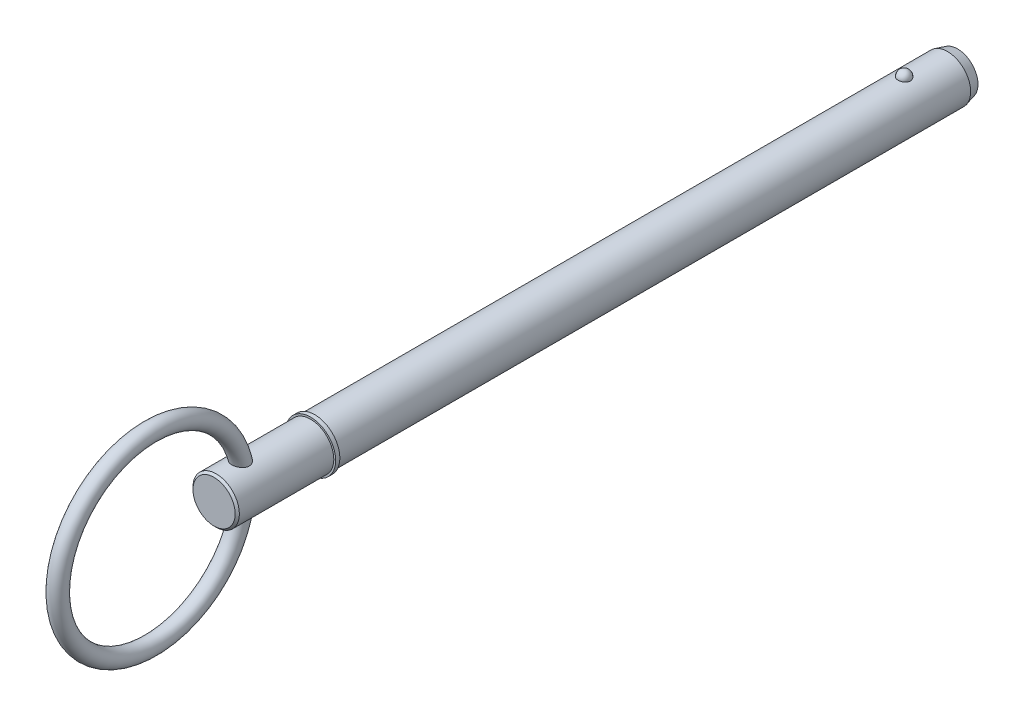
ISO-10303-21;
HEADER;
FILE_DESCRIPTION(('STEP AP214'),'2;1');
FILE_NAME('part.step','',(''),(''),'','','');
FILE_SCHEMA(('AUTOMOTIVE_DESIGN { 1 0 10303 214 1 1 1 1 }'));
ENDSEC;
DATA;
#1=APPLICATION_CONTEXT('core data for automotive mechanical design processes');
#2=APPLICATION_PROTOCOL_DEFINITION('international standard','automotive_design',2000,#1);
#3=PRODUCT_CONTEXT('',#1,'mechanical');
#4=PRODUCT('Part','Part','',(#3));
#5=PRODUCT_RELATED_PRODUCT_CATEGORY('part','',(#4));
#6=PRODUCT_DEFINITION_FORMATION('','',#4);
#7=PRODUCT_DEFINITION_CONTEXT('part definition',#1,'design');
#8=PRODUCT_DEFINITION('design','',#6,#7);
#9=PRODUCT_DEFINITION_SHAPE('','',#8);
#10=(LENGTH_UNIT() NAMED_UNIT(*) SI_UNIT(.MILLI.,.METRE.));
#11=(NAMED_UNIT(*) PLANE_ANGLE_UNIT() SI_UNIT($,.RADIAN.));
#12=(NAMED_UNIT(*) SI_UNIT($,.STERADIAN.) SOLID_ANGLE_UNIT());
#13=UNCERTAINTY_MEASURE_WITH_UNIT(LENGTH_MEASURE(1.E-05),#10,'distance_accuracy_value','');
#14=(GEOMETRIC_REPRESENTATION_CONTEXT(3) GLOBAL_UNCERTAINTY_ASSIGNED_CONTEXT((#13)) GLOBAL_UNIT_ASSIGNED_CONTEXT((#10,
#11,#12)) REPRESENTATION_CONTEXT('',''));
#15=CARTESIAN_POINT('',(0.,0.,0.));
#16=DIRECTION('',(0.,0.,1.));
#17=DIRECTION('',(1.,0.,0.));
#18=AXIS2_PLACEMENT_3D('',#15,#16,#17);
#19=CARTESIAN_POINT('',(0.,0.,139.7));
#20=DIRECTION('',(0.,0.,-1.));
#21=DIRECTION('',(-1.,0.,0.));
#22=AXIS2_PLACEMENT_3D('',#19,#20,#21);
#23=CYLINDRICAL_SURFACE('',#22,5.555);
#24=CARTESIAN_POINT('',(1.47653932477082,5.35517101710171,-1.49));
#25=CARTESIAN_POINT('',(1.4765376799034,5.35517235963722,-1.40667872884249));
#26=CARTESIAN_POINT('',(1.4697233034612,5.35706459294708,-1.32333626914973));
#27=CARTESIAN_POINT('',(1.4426291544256,5.36442332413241,-1.15900769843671));
#28=CARTESIAN_POINT('',(1.42234344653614,5.36989139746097,-1.07802264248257));
#29=CARTESIAN_POINT('',(1.36882802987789,5.38378061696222,-0.920757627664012));
#30=CARTESIAN_POINT('',(1.33560404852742,5.39220045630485,-0.844475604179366));
#31=CARTESIAN_POINT('',(1.25704906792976,5.41105136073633,-0.698703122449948));
#32=CARTESIAN_POINT('',(1.21171855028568,5.42148234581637,-0.629212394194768));
#33=CARTESIAN_POINT('',(1.10986325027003,5.44324765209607,-0.498626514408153));
#34=CARTESIAN_POINT('',(1.05328868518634,5.45458585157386,-0.437570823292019));
#35=CARTESIAN_POINT('',(0.930545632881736,5.4768596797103,-0.325918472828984));
#36=CARTESIAN_POINT('',(0.864377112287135,5.48779530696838,-0.275321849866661));
#37=CARTESIAN_POINT('',(0.724412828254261,5.50801510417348,-0.186125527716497));
#38=CARTESIAN_POINT('',(0.650637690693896,5.51730356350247,-0.147494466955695));
#39=CARTESIAN_POINT('',(0.497383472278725,5.53322345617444,-0.0831582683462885));
#40=CARTESIAN_POINT('',(0.417904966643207,5.53985515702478,-0.0574518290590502));
#41=CARTESIAN_POINT('',(0.256903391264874,5.54963245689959,-0.0200294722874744));
#42=CARTESIAN_POINT('',(0.17543580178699,5.55283384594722,-0.00808940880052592));
#43=CARTESIAN_POINT('',(0.011588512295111,5.55559187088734,0.00221439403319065));
#44=CARTESIAN_POINT('',(-0.0707911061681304,5.55514883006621,0.000579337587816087));
#45=CARTESIAN_POINT('',(-0.232980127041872,5.55069756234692,-0.0161051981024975));
#46=CARTESIAN_POINT('',(-0.312809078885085,5.54673626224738,-0.0309781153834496));
#47=CARTESIAN_POINT('',(-0.468771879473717,5.5357377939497,-0.0734743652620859));
#48=CARTESIAN_POINT('',(-0.544905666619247,5.52870057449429,-0.101097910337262));
#49=CARTESIAN_POINT('',(-0.691800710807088,5.51225307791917,-0.168516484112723));
#50=CARTESIAN_POINT('',(-0.762530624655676,5.50283015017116,-0.2083766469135));
#51=CARTESIAN_POINT('',(-0.896294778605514,5.48263289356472,-0.299136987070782));
#52=CARTESIAN_POINT('',(-0.959328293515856,5.47185843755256,-0.350038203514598));
#53=CARTESIAN_POINT('',(-1.07712789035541,5.44990641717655,-0.462517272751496));
#54=CARTESIAN_POINT('',(-1.13172901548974,5.43872509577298,-0.524267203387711));
#55=CARTESIAN_POINT('',(-1.2299173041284,5.41736658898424,-0.656133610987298));
#56=CARTESIAN_POINT('',(-1.2735037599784,5.40718946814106,-0.726250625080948));
#57=CARTESIAN_POINT('',(-1.34896420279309,5.38886361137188,-0.873713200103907));
#58=CARTESIAN_POINT('',(-1.38071142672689,5.38073711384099,-0.951126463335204));
#59=CARTESIAN_POINT('',(-1.4310375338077,5.36757288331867,-1.11037033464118));
#60=CARTESIAN_POINT('',(-1.44961676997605,5.3625350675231,-1.19220082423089));
#61=CARTESIAN_POINT('',(-1.47308754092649,5.35613553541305,-1.35761209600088));
#62=CARTESIAN_POINT('',(-1.47803294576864,5.35475935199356,-1.44118467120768));
#63=CARTESIAN_POINT('',(-1.47426441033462,5.35579807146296,-1.6079958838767));
#64=CARTESIAN_POINT('',(-1.46555080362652,5.35821288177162,-1.69123452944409));
#65=CARTESIAN_POINT('',(-1.43475662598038,5.36653964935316,-1.8546288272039));
#66=CARTESIAN_POINT('',(-1.41273621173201,5.37243586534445,-1.93479663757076));
#67=CARTESIAN_POINT('',(-1.35593151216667,5.38705199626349,-2.09020110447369));
#68=CARTESIAN_POINT('',(-1.32114675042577,5.39577201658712,-2.16543757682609));
#69=CARTESIAN_POINT('',(-1.23947506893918,5.41511674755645,-2.30926926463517));
#70=CARTESIAN_POINT('',(-1.1925277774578,5.42575087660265,-2.37782893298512));
#71=CARTESIAN_POINT('',(-1.08780725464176,5.44771095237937,-2.50598876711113));
#72=CARTESIAN_POINT('',(-1.03003365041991,5.4590369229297,-2.56558862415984));
#73=CARTESIAN_POINT('',(-0.90495349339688,5.48116073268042,-2.67436535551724));
#74=CARTESIAN_POINT('',(-0.837616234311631,5.49195671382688,-2.7235073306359));
#75=CARTESIAN_POINT('',(-0.69537970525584,5.51177099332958,-2.8097317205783));
#76=CARTESIAN_POINT('',(-0.620480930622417,5.52078940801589,-2.84681492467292));
#77=CARTESIAN_POINT('',(-0.466144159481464,5.53594369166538,-2.90749751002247));
#78=CARTESIAN_POINT('',(-0.386768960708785,5.54211181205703,-2.93124844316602));
#79=CARTESIAN_POINT('',(-0.224991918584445,5.5510324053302,-2.96523308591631));
#80=CARTESIAN_POINT('',(-0.142590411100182,5.55378525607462,-2.97546829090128));
#81=CARTESIAN_POINT('',(0.0213711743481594,5.55555351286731,-2.98206550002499));
#82=CARTESIAN_POINT('',(0.102921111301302,5.55463281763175,-2.97866468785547));
#83=CARTESIAN_POINT('',(0.2642564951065,5.54929804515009,-2.95862186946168));
#84=CARTESIAN_POINT('',(0.344041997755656,5.54488407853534,-2.94198028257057));
#85=CARTESIAN_POINT('',(0.499344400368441,5.53305794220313,-2.89600357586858));
#86=CARTESIAN_POINT('',(0.574874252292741,5.52565550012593,-2.86670961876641));
#87=CARTESIAN_POINT('',(0.71989857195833,5.50863937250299,-2.79624249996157));
#88=CARTESIAN_POINT('',(0.78939269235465,5.49902555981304,-2.75506865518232));
#89=CARTESIAN_POINT('',(0.921480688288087,5.47845199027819,-2.66127110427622));
#90=CARTESIAN_POINT('',(0.983960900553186,5.46747485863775,-2.60849118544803));
#91=CARTESIAN_POINT('',(1.09925057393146,5.44546837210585,-2.49325304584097));
#92=CARTESIAN_POINT('',(1.15205830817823,5.43443900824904,-2.43079310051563));
#93=CARTESIAN_POINT('',(1.24742943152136,5.41335152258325,-2.29680711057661));
#94=CARTESIAN_POINT('',(1.28981661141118,5.40331162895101,-2.22515272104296));
#95=CARTESIAN_POINT('',(1.36214937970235,5.38553336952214,-2.07558035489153));
#96=CARTESIAN_POINT('',(1.39210034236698,5.37779400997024,-1.99766510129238));
#97=CARTESIAN_POINT('',(1.43569518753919,5.36630594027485,-1.84848338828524));
#98=CARTESIAN_POINT('',(1.45098536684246,5.36216169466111,-1.77772322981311));
#99=CARTESIAN_POINT('',(1.47140805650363,5.35659367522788,-1.63464735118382));
#100=CARTESIAN_POINT('',(1.47654075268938,5.35516985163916,-1.5623316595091));
#101=CARTESIAN_POINT('',(1.47653932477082,5.35517101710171,-1.49));
#102=B_SPLINE_CURVE_WITH_KNOTS('',3,(#24,#25,#26,#27,#28,#29,#30,#31,#32,#33,#34,#35,#36,#37,
#38,#39,#40,#41,#42,#43,#44,#45,#46,#47,#48,#49,#50,#51,#52,#53,#54,#55,#56,#57,#58,#59,#60,#61,
#62,#63,#64,#65,#66,#67,#68,#69,#70,#71,#72,#73,#74,#75,#76,#77,#78,#79,#80,#81,#82,#83,#84,#85,
#86,#87,#88,#89,#90,#91,#92,#93,#94,#95,#96,#97,#98,#99,#100,#101),.UNSPECIFIED.,.T.,.F.,(4,2,2,
2,2,2,2,2,2,2,2,2,2,2,2,2,2,2,2,2,2,2,2,2,2,2,2,2,2,2,2,2,2,2,2,2,2,2,4),(0.,0.249703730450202,
0.4995175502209,0.749220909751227,0.998914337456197,1.24973894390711,1.50056442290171,
1.75072681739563,2.00086401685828,2.24686822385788,2.49285060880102,2.73560052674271,
2.97835449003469,3.22242369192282,3.46651587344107,3.71490232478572,3.96330473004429,
4.21429522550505,4.46527899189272,4.71526963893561,4.96525418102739,5.21411697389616,
5.46298905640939,5.71312097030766,5.96326150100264,6.21422412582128,6.46517032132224,
6.71320296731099,6.96120816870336,7.20491846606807,7.44862104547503,7.69153667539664,
7.93446627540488,8.18089104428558,8.42735976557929,8.67774679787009,8.92802551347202,
9.14479867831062,9.36156787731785),.UNSPECIFIED.);
#103=CARTESIAN_POINT('',(1.47653932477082,5.35517101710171,-1.49));
#104=VERTEX_POINT('',#103);
#105=EDGE_CURVE('E99',#104,#104,#102,.T.);
#106=ORIENTED_EDGE('',*,*,#105,.T.);
#107=EDGE_LOOP('',(#106));
#108=FACE_BOUND('',#107,.T.);
#109=CARTESIAN_POINT('',(0.,0.,-11.87));
#110=DIRECTION('',(0.,0.,-1.));
#111=DIRECTION('',(-1.,0.,0.));
#112=AXIS2_PLACEMENT_3D('',#109,#110,#111);
#113=CIRCLE('',#112,5.555);
#114=CARTESIAN_POINT('',(5.555,0.,-11.87));
#115=VERTEX_POINT('',#114);
#116=EDGE_CURVE('E107',#115,#115,#113,.F.);
#117=ORIENTED_EDGE('',*,*,#116,.T.);
#118=EDGE_LOOP('',(#117));
#119=FACE_BOUND('',#118,.T.);
#120=CARTESIAN_POINT('',(0.,0.,139.7));
#121=DIRECTION('',(0.,0.,1.));
#122=DIRECTION('',(1.,0.,0.));
#123=AXIS2_PLACEMENT_3D('',#120,#121,#122);
#124=CIRCLE('',#123,5.555);
#125=CARTESIAN_POINT('',(5.555,0.,139.7));
#126=VERTEX_POINT('',#125);
#127=EDGE_CURVE('E105',#126,#126,#124,.T.);
#128=ORIENTED_EDGE('',*,*,#127,.F.);
#129=EDGE_LOOP('',(#128));
#130=FACE_BOUND('',#129,.T.);
#131=ADVANCED_FACE('F39',(#108,#119,#130),#23,.T.);
#132=CARTESIAN_POINT('',(0.,0.,-14.27));
#133=DIRECTION('',(0.,0.,-1.));
#134=DIRECTION('',(-1.,0.,0.));
#135=AXIS2_PLACEMENT_3D('',#132,#133,#134);
#136=PLANE('',#135);
#137=CARTESIAN_POINT('',(0.,0.,-14.27));
#138=DIRECTION('',(0.,0.,-1.));
#139=DIRECTION('',(-1.,0.,0.));
#140=AXIS2_PLACEMENT_3D('',#137,#138,#139);
#141=CIRCLE('',#140,4.9119219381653);
#142=CARTESIAN_POINT('',(4.9119219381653,0.,-14.27));
#143=VERTEX_POINT('',#142);
#144=EDGE_CURVE('E140',#143,#143,#141,.T.);
#145=ORIENTED_EDGE('',*,*,#144,.T.);
#146=EDGE_LOOP('',(#145));
#147=FACE_BOUND('',#146,.T.);
#148=ADVANCED_FACE('F85',(#147),#136,.T.);
#149=CARTESIAN_POINT('',(0.,0.,-14.27));
#150=DIRECTION('',(0.,0.,1.));
#151=DIRECTION('',(1.,0.,0.));
#152=AXIS2_PLACEMENT_3D('',#149,#150,#151);
#153=CONICAL_SURFACE('',#152,4.9119219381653,0.261799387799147);
#154=CARTESIAN_POINT('',(5.555,0.,-11.87));
#155=CARTESIAN_POINT('',(5.54830127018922,0.,-11.895));
#156=CARTESIAN_POINT('',(5.54160254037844,0.,-11.92));
#157=CARTESIAN_POINT('',(5.52820508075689,0.,-11.97));
#158=CARTESIAN_POINT('',(5.52150635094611,0.,-11.995));
#159=CARTESIAN_POINT('',(5.50810889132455,0.,-12.045));
#160=CARTESIAN_POINT('',(5.50141016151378,0.,-12.07));
#161=CARTESIAN_POINT('',(5.48801270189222,0.,-12.12));
#162=CARTESIAN_POINT('',(5.48131397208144,0.,-12.145));
#163=CARTESIAN_POINT('',(5.46791651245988,0.,-12.195));
#164=CARTESIAN_POINT('',(5.46121778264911,0.,-12.22));
#165=CARTESIAN_POINT('',(5.44782032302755,0.,-12.27));
#166=CARTESIAN_POINT('',(5.44112159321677,0.,-12.295));
#167=CARTESIAN_POINT('',(5.42772413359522,0.,-12.345));
#168=CARTESIAN_POINT('',(5.42102540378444,0.,-12.37));
#169=CARTESIAN_POINT('',(5.40762794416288,0.,-12.42));
#170=CARTESIAN_POINT('',(5.4009292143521,0.,-12.445));
#171=CARTESIAN_POINT('',(5.38753175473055,0.,-12.495));
#172=CARTESIAN_POINT('',(5.38083302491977,0.,-12.52));
#173=CARTESIAN_POINT('',(5.36743556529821,0.,-12.57));
#174=CARTESIAN_POINT('',(5.36073683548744,0.,-12.595));
#175=CARTESIAN_POINT('',(5.34733937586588,0.,-12.645));
#176=CARTESIAN_POINT('',(5.3406406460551,0.,-12.67));
#177=CARTESIAN_POINT('',(5.32724318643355,0.,-12.72));
#178=CARTESIAN_POINT('',(5.32054445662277,0.,-12.745));
#179=CARTESIAN_POINT('',(5.30714699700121,0.,-12.795));
#180=CARTESIAN_POINT('',(5.30044826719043,0.,-12.82));
#181=CARTESIAN_POINT('',(5.28705080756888,0.,-12.87));
#182=CARTESIAN_POINT('',(5.2803520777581,0.,-12.895));
#183=CARTESIAN_POINT('',(5.26695461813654,0.,-12.945));
#184=CARTESIAN_POINT('',(5.26025588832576,0.,-12.97));
#185=CARTESIAN_POINT('',(5.24685842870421,0.,-13.02));
#186=CARTESIAN_POINT('',(5.24015969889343,0.,-13.045));
#187=CARTESIAN_POINT('',(5.22676223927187,0.,-13.095));
#188=CARTESIAN_POINT('',(5.2200635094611,0.,-13.12));
#189=CARTESIAN_POINT('',(5.20666604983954,0.,-13.17));
#190=CARTESIAN_POINT('',(5.19996732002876,0.,-13.195));
#191=CARTESIAN_POINT('',(5.18656986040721,0.,-13.245));
#192=CARTESIAN_POINT('',(5.17987113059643,0.,-13.27));
#193=CARTESIAN_POINT('',(5.16647367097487,0.,-13.32));
#194=CARTESIAN_POINT('',(5.15977494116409,0.,-13.345));
#195=CARTESIAN_POINT('',(5.14637748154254,0.,-13.395));
#196=CARTESIAN_POINT('',(5.13967875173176,0.,-13.42));
#197=CARTESIAN_POINT('',(5.1262812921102,0.,-13.47));
#198=CARTESIAN_POINT('',(5.11958256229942,0.,-13.495));
#199=CARTESIAN_POINT('',(5.10618510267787,0.,-13.545));
#200=CARTESIAN_POINT('',(5.09948637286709,0.,-13.57));
#201=CARTESIAN_POINT('',(5.08608891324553,0.,-13.62));
#202=CARTESIAN_POINT('',(5.07939018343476,0.,-13.645));
#203=CARTESIAN_POINT('',(5.0659927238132,0.,-13.695));
#204=CARTESIAN_POINT('',(5.05929399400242,0.,-13.72));
#205=CARTESIAN_POINT('',(5.04589653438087,0.,-13.77));
#206=CARTESIAN_POINT('',(5.03919780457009,0.,-13.795));
#207=CARTESIAN_POINT('',(5.02580034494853,0.,-13.845));
#208=CARTESIAN_POINT('',(5.01910161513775,0.,-13.87));
#209=CARTESIAN_POINT('',(5.0057041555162,0.,-13.92));
#210=CARTESIAN_POINT('',(4.99900542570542,0.,-13.945));
#211=CARTESIAN_POINT('',(4.98560796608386,0.,-13.995));
#212=CARTESIAN_POINT('',(4.97890923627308,0.,-14.02));
#213=CARTESIAN_POINT('',(4.96551177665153,0.,-14.07));
#214=CARTESIAN_POINT('',(4.95881304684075,0.,-14.095));
#215=CARTESIAN_POINT('',(4.94541558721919,0.,-14.145));
#216=CARTESIAN_POINT('',(4.93871685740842,0.,-14.17));
#217=CARTESIAN_POINT('',(4.92531939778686,0.,-14.22));
#218=CARTESIAN_POINT('',(4.91862066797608,0.,-14.245));
#219=CARTESIAN_POINT('',(4.9119219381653,0.,-14.27));
#220=B_SPLINE_CURVE_WITH_KNOTS('',3,(#154,#155,#156,#157,#158,#159,#160,#161,#162,#163,#164,
#165,#166,#167,#168,#169,#170,#171,#172,#173,#174,#175,#176,#177,#178,#179,#180,#181,#182,#183,
#184,#185,#186,#187,#188,#189,#190,#191,#192,#193,#194,#195,#196,#197,#198,#199,#200,#201,#202,
#203,#204,#205,#206,#207,#208,#209,#210,#211,#212,#213,#214,#215,#216,#217,#218,#219),
.UNSPECIFIED.,.F.,.F.,(4,2,2,2,2,2,2,2,2,2,2,2,2,2,2,2,2,2,2,2,2,2,2,2,2,2,2,2,2,2,2,2,4),(0.,
0.0776457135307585,0.155291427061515,0.232937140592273,0.31058285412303,0.388228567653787,
0.465874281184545,0.543519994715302,0.621165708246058,0.698811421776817,0.776457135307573,
0.854102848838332,0.931748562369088,1.00939427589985,1.0870399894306,1.16468570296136,
1.24233141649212,1.31997713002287,1.39762284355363,1.47526855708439,1.55291427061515,
1.6305599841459,1.70820569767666,1.78585141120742,1.86349712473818,1.94114283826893,
2.01878855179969,2.09643426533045,2.17407997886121,2.25172569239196,2.32937140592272,
2.40701711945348,2.48466283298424),.UNSPECIFIED.);
#221=EDGE_CURVE('BSEAM91',#115,#143,#220,.T.);
#222=ORIENTED_EDGE('',*,*,#116,.F.);
#223=ORIENTED_EDGE('',*,*,#144,.F.);
#224=ORIENTED_EDGE('',*,*,#221,.T.);
#225=ORIENTED_EDGE('',*,*,#221,.F.);
#226=EDGE_LOOP('',(#222,#224,#223,#225));
#227=FACE_BOUND('',#226,.T.);
#228=ADVANCED_FACE('F91',(#227),#153,.T.);
#229=CARTESIAN_POINT('',(0.,5.555,-1.49));
#230=DIRECTION('',(0.,1.,0.));
#231=DIRECTION('',(0.,0.,1.));
#232=AXIS2_PLACEMENT_3D('',#229,#230,#231);
#233=SPHERICAL_SURFACE('',#232,1.49);
#234=ORIENTED_EDGE('',*,*,#105,.F.);
#235=EDGE_LOOP('',(#234));
#236=FACE_BOUND('',#235,.T.);
#237=ADVANCED_FACE('F110',(#236),#233,.T.);
#238=CARTESIAN_POINT('',(0.,0.,139.7));
#239=DIRECTION('',(0.,0.,-1.));
#240=DIRECTION('',(-1.,0.,0.));
#241=AXIS2_PLACEMENT_3D('',#238,#239,#240);
#242=PLANE('',#241);
#243=ORIENTED_EDGE('',*,*,#127,.T.);
#244=EDGE_LOOP('',(#243));
#245=FACE_BOUND('',#244,.T.);
#246=CARTESIAN_POINT('',(0.,0.,139.7));
#247=DIRECTION('',(0.,0.,-1.));
#248=DIRECTION('',(-1.,0.,0.));
#249=AXIS2_PLACEMENT_3D('',#246,#247,#248);
#250=CIRCLE('',#249,6.);
#251=CARTESIAN_POINT('',(-6.,0.,139.7));
#252=VERTEX_POINT('',#251);
#253=EDGE_CURVE('E106',#252,#252,#250,.T.);
#254=ORIENTED_EDGE('',*,*,#253,.T.);
#255=EDGE_LOOP('',(#254));
#256=FACE_BOUND('',#255,.T.);
#257=ADVANCED_FACE('F114',(#245,#256),#242,.T.);
#258=CARTESIAN_POINT('',(0.,0.,33.7287874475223));
#259=DIRECTION('',(0.,0.,-1.));
#260=DIRECTION('',(-1.,0.,0.));
#261=AXIS2_PLACEMENT_3D('',#258,#259,#260);
#262=CYLINDRICAL_SURFACE('',#261,6.);
#263=CARTESIAN_POINT('',(0.,0.,140.7));
#264=DIRECTION('',(0.,0.,-1.));
#265=DIRECTION('',(-1.,0.,0.));
#266=AXIS2_PLACEMENT_3D('',#263,#264,#265);
#267=CIRCLE('',#266,6.);
#268=CARTESIAN_POINT('',(-6.,0.,140.7));
#269=VERTEX_POINT('',#268);
#270=EDGE_CURVE('E131',#269,#269,#267,.T.);
#271=ORIENTED_EDGE('',*,*,#270,.T.);
#272=EDGE_LOOP('',(#271));
#273=FACE_BOUND('',#272,.T.);
#274=ORIENTED_EDGE('',*,*,#253,.F.);
#275=EDGE_LOOP('',(#274));
#276=FACE_BOUND('',#275,.T.);
#277=ADVANCED_FACE('F118',(#273,#276),#262,.T.);
#278=CARTESIAN_POINT('',(0.,6.,140.7));
#279=DIRECTION('',(0.,0.,1.));
#280=DIRECTION('',(1.,0.,0.));
#281=AXIS2_PLACEMENT_3D('',#278,#279,#280);
#282=PLANE('',#281);
#283=CARTESIAN_POINT('',(0.,0.,140.7));
#284=DIRECTION('',(0.,0.,1.));
#285=DIRECTION('',(1.,0.,0.));
#286=AXIS2_PLACEMENT_3D('',#283,#284,#285);
#287=CIRCLE('',#286,5.555);
#288=CARTESIAN_POINT('',(5.555,0.,140.7));
#289=VERTEX_POINT('',#288);
#290=EDGE_CURVE('E109',#289,#289,#287,.T.);
#291=ORIENTED_EDGE('',*,*,#290,.F.);
#292=EDGE_LOOP('',(#291));
#293=FACE_BOUND('',#292,.T.);
#294=ORIENTED_EDGE('',*,*,#270,.F.);
#295=EDGE_LOOP('',(#294));
#296=FACE_BOUND('',#295,.T.);
#297=ADVANCED_FACE('F82',(#293,#296),#282,.T.);
#298=CARTESIAN_POINT('',(0.,0.,163.83));
#299=DIRECTION('',(0.,0.,-1.));
#300=DIRECTION('',(-1.,0.,0.));
#301=AXIS2_PLACEMENT_3D('',#298,#299,#300);
#302=CYLINDRICAL_SURFACE('',#301,5.555);
#303=CARTESIAN_POINT('',(-0.961380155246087,-5.47117658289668,155.708733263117));
#304=CARTESIAN_POINT('',(-0.863231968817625,-5.4884217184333,155.657515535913));
#305=CARTESIAN_POINT('',(-0.760548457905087,-5.50372118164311,155.614318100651));
#306=CARTESIAN_POINT('',(-0.548956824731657,-5.52883500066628,155.544912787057));
#307=CARTESIAN_POINT('',(-0.440048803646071,-5.53864944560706,155.518704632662));
#308=CARTESIAN_POINT('',(-0.219033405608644,-5.55178384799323,155.483864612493));
#309=CARTESIAN_POINT('',(-0.106925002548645,-5.55510169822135,155.475238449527));
#310=CARTESIAN_POINT('',(0.117238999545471,-5.55489351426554,155.475783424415));
#311=CARTESIAN_POINT('',(0.229294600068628,-5.55136768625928,155.484954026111));
#312=CARTESIAN_POINT('',(0.449588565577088,-5.5378711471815,155.520784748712));
#313=CARTESIAN_POINT('',(0.557843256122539,-5.52793284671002,155.547356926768));
#314=CARTESIAN_POINT('',(0.768116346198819,-5.50265785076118,155.617309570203));
#315=CARTESIAN_POINT('',(0.870134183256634,-5.48732066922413,155.660691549));
#316=CARTESIAN_POINT('',(1.06580880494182,-5.45270790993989,155.763685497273));
#317=CARTESIAN_POINT('',(1.1594033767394,-5.43340601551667,155.823406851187));
#318=CARTESIAN_POINT('',(1.33484934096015,-5.39298781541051,155.957672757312));
#319=CARTESIAN_POINT('',(1.41670019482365,-5.37187142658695,156.032217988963));
#320=CARTESIAN_POINT('',(1.56628651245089,-5.33017932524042,156.194433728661));
#321=CARTESIAN_POINT('',(1.63402728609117,-5.30960341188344,156.282099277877));
#322=CARTESIAN_POINT('',(1.75338323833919,-5.27139606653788,156.46835593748));
#323=CARTESIAN_POINT('',(1.80500413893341,-5.25376359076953,156.566943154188));
#324=CARTESIAN_POINT('',(1.88923054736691,-5.22405733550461,156.768866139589));
#325=CARTESIAN_POINT('',(1.92240068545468,-5.21182119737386,156.871942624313));
#326=CARTESIAN_POINT('',(1.97156802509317,-5.19342304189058,157.082612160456));
#327=CARTESIAN_POINT('',(1.98756752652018,-5.18726021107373,157.190204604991));
#328=CARTESIAN_POINT('',(2.00238957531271,-5.1815556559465,157.404813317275));
#329=CARTESIAN_POINT('',(2.0015062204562,-5.18190056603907,157.511807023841));
#330=CARTESIAN_POINT('',(1.98404322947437,-5.18861029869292,157.724294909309));
#331=CARTESIAN_POINT('',(1.96745884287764,-5.19497694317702,157.82978862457));
#332=CARTESIAN_POINT('',(1.91810947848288,-5.21340722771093,158.043734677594));
#333=CARTESIAN_POINT('',(1.88435438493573,-5.22581720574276,158.151927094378));
#334=CARTESIAN_POINT('',(1.80161540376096,-5.25491400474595,158.361718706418));
#335=CARTESIAN_POINT('',(1.7526231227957,-5.27160318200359,158.463314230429));
#336=CARTESIAN_POINT('',(1.63431251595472,-5.30955034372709,158.668856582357));
#337=CARTESIAN_POINT('',(1.5633341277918,-5.33111051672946,158.771796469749));
#338=CARTESIAN_POINT('',(1.4052960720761,-5.37493145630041,158.96447165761));
#339=CARTESIAN_POINT('',(1.31822569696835,-5.39719268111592,159.054198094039));
#340=CARTESIAN_POINT('',(1.12728892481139,-5.44031451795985,159.219004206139));
#341=CARTESIAN_POINT('',(1.02309899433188,-5.46113424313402,159.293723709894));
#342=CARTESIAN_POINT('',(0.801576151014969,-5.49800171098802,159.421805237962));
#343=CARTESIAN_POINT('',(0.684264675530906,-5.51405708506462,159.475201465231));
#344=CARTESIAN_POINT('',(0.45687763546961,-5.53719478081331,159.550980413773));
#345=CARTESIAN_POINT('',(0.34797457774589,-5.54519800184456,159.576584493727));
#346=CARTESIAN_POINT('',(0.127042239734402,-5.55464249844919,159.606731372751));
#347=CARTESIAN_POINT('',(0.015016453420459,-5.55609083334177,159.611296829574));
#348=CARTESIAN_POINT('',(-0.19199318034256,-5.55250986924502,159.599911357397));
#349=CARTESIAN_POINT('',(-0.287160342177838,-5.54836194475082,159.586752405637));
#350=CARTESIAN_POINT('',(-0.473863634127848,-5.53554271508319,159.545489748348));
#351=CARTESIAN_POINT('',(-0.565399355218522,-5.52687090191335,159.517384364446));
#352=CARTESIAN_POINT('',(-0.743786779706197,-5.50572322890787,159.447293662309));
#353=CARTESIAN_POINT('',(-0.830566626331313,-5.49320168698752,159.405141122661));
#354=CARTESIAN_POINT('',(-0.996720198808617,-5.46549909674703,159.308875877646));
#355=CARTESIAN_POINT('',(-1.07609119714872,-5.45031707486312,159.254758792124));
#356=CARTESIAN_POINT('',(-1.23672272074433,-5.41628785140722,159.128211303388));
#357=CARTESIAN_POINT('',(-1.3167603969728,-5.39722327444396,159.05428911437));
#358=CARTESIAN_POINT('',(-1.46504263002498,-5.3588760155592,158.895462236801));
#359=CARTESIAN_POINT('',(-1.5332782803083,-5.33959318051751,158.810549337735));
#360=CARTESIAN_POINT('',(-1.6660227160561,-5.29979878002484,158.618697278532));
#361=CARTESIAN_POINT('',(-1.72857256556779,-5.27951148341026,158.510347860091));
#362=CARTESIAN_POINT('',(-1.83559571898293,-5.24326402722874,158.284325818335));
#363=CARTESIAN_POINT('',(-1.88006296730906,-5.22730531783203,158.166650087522));
#364=CARTESIAN_POINT('',(-1.94988009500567,-5.20167534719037,157.922087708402));
#365=CARTESIAN_POINT('',(-1.97477410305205,-5.19215470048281,157.79505279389));
#366=CARTESIAN_POINT('',(-2.00168294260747,-5.18184594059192,157.538249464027));
#367=CARTESIAN_POINT('',(-2.00372217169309,-5.18104851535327,157.40848411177));
#368=CARTESIAN_POINT('',(-1.98467753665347,-5.18836681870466,157.164652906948));
#369=CARTESIAN_POINT('',(-1.96600067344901,-5.19555485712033,157.050370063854));
#370=CARTESIAN_POINT('',(-1.90923541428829,-5.21668050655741,156.827389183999));
#371=CARTESIAN_POINT('',(-1.87115335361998,-5.23061591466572,156.718689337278));
#372=CARTESIAN_POINT('',(-1.78015350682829,-5.26224244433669,156.518371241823));
#373=CARTESIAN_POINT('',(-1.72857344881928,-5.27957041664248,156.42608293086));
#374=CARTESIAN_POINT('',(-1.61106729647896,-5.31660340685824,156.251684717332));
#375=CARTESIAN_POINT('',(-1.54514024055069,-5.33630858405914,156.169575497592));
#376=CARTESIAN_POINT('',(-1.39929408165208,-5.37641320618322,156.015887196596));
#377=CARTESIAN_POINT('',(-1.31912544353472,-5.39681868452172,155.944546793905));
#378=CARTESIAN_POINT('',(-1.14786008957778,-5.43582099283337,155.815855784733));
#379=CARTESIAN_POINT('',(-1.05676174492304,-5.4544175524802,155.758507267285));
#380=CARTESIAN_POINT('',(-0.961380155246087,-5.47117658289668,155.708733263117));
#381=B_SPLINE_CURVE_WITH_KNOTS('',3,(#303,#304,#305,#306,#307,#308,#309,#310,#311,#312,#313,
#314,#315,#316,#317,#318,#319,#320,#321,#322,#323,#324,#325,#326,#327,#328,#329,#330,#331,#332,
#333,#334,#335,#336,#337,#338,#339,#340,#341,#342,#343,#344,#345,#346,#347,#348,#349,#350,#351,
#352,#353,#354,#355,#356,#357,#358,#359,#360,#361,#362,#363,#364,#365,#366,#367,#368,#369,#370,
#371,#372,#373,#374,#375,#376,#377,#378,#379,#380),.UNSPECIFIED.,.T.,.F.,(4,2,2,2,2,2,2,2,2,2,2,
2,2,2,2,2,2,2,2,2,2,2,2,2,2,2,2,2,2,2,2,2,2,2,2,2,2,2,4),(0.,0.335747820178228,
0.671490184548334,1.00734143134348,1.34318256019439,1.67733940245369,2.01152633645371,
2.34800767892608,2.6845044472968,3.02087435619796,3.35712472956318,3.68242216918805,
4.00767603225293,4.32726924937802,4.6469591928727,4.9876216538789,5.32847210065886,
5.7074287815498,6.08663853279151,6.47407889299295,6.86089527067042,7.19531213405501,
7.52936875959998,7.81649827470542,8.10366003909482,8.39437023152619,8.68518702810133,
9.01572837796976,9.34651809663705,9.72504519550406,10.1036989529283,10.4909301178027,
10.8777478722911,11.2239231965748,11.5699855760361,11.8899109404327,12.2098577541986,
12.5360928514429,12.8623766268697),.UNSPECIFIED.);
#382=CARTESIAN_POINT('',(-0.961380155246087,-5.47117658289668,155.708733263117));
#383=VERTEX_POINT('',#382);
#384=EDGE_CURVE('E10',#383,#383,#381,.T.);
#385=ORIENTED_EDGE('',*,*,#384,.F.);
#386=EDGE_LOOP('',(#385));
#387=FACE_BOUND('',#386,.T.);
#388=CARTESIAN_POINT('',(-0.961380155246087,5.47117658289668,155.708733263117));
#389=CARTESIAN_POINT('',(-1.05891474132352,5.45403910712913,155.759631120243));
#390=CARTESIAN_POINT('',(-1.15197270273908,5.43497920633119,155.818451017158));
#391=CARTESIAN_POINT('',(-1.32661268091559,5.39501222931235,155.95070162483));
#392=CARTESIAN_POINT('',(-1.40819495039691,5.37410519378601,156.024132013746));
#393=CARTESIAN_POINT('',(-1.55769110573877,5.33269731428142,156.184098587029));
#394=CARTESIAN_POINT('',(-1.62558729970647,5.31219702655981,156.270651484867));
#395=CARTESIAN_POINT('',(-1.74556031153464,5.2739951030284,156.454646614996));
#396=CARTESIAN_POINT('',(-1.7976419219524,5.25629262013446,156.552085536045));
#397=CARTESIAN_POINT('',(-1.88339939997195,5.22617061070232,156.752565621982));
#398=CARTESIAN_POINT('',(-1.91750373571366,5.21362983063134,156.855405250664));
#399=CARTESIAN_POINT('',(-1.96852412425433,5.194582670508,157.065778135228));
#400=CARTESIAN_POINT('',(-1.98544249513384,5.18807547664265,157.173310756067));
#401=CARTESIAN_POINT('',(-2.00201964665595,5.18170011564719,157.387819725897));
#402=CARTESIAN_POINT('',(-2.00199605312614,5.18170977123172,157.494768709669));
#403=CARTESIAN_POINT('',(-1.98621575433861,5.18777751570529,157.707306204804));
#404=CARTESIAN_POINT('',(-1.97045441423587,5.19383738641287,157.812894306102));
#405=CARTESIAN_POINT('',(-1.92280904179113,5.21167084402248,158.026914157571));
#406=CARTESIAN_POINT('',(-1.88996782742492,5.22378174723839,158.135103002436));
#407=CARTESIAN_POINT('',(-1.80906901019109,5.25234475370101,158.345029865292));
#408=CARTESIAN_POINT('',(-1.76100319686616,5.26879919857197,158.446764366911));
#409=CARTESIAN_POINT('',(-1.64464870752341,5.30634509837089,158.652788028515));
#410=CARTESIAN_POINT('',(-1.57469702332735,5.32774959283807,158.756085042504));
#411=CARTESIAN_POINT('',(-1.41872356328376,5.37138743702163,158.949688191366));
#412=CARTESIAN_POINT('',(-1.33269066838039,5.39362135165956,159.039985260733));
#413=CARTESIAN_POINT('',(-1.14345202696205,5.43692909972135,159.206557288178));
#414=CARTESIAN_POINT('',(-1.03986000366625,5.45795811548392,159.282409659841));
#415=CARTESIAN_POINT('',(-0.819338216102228,5.49537389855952,159.412916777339));
#416=CARTESIAN_POINT('',(-0.702429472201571,5.51176784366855,159.467604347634));
#417=CARTESIAN_POINT('',(-0.475167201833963,5.53565843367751,159.54602203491));
#418=CARTESIAN_POINT('',(-0.365997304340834,5.5440461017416,159.572893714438));
#419=CARTESIAN_POINT('',(-0.144272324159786,5.55422966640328,159.605426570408));
#420=CARTESIAN_POINT('',(-0.0317212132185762,5.55603301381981,159.611111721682));
#421=CARTESIAN_POINT('',(0.176166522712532,5.55303883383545,159.601592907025));
#422=CARTESIAN_POINT('',(0.271662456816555,5.54914868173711,159.589260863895));
#423=CARTESIAN_POINT('',(0.45914083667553,5.53678955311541,159.549523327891));
#424=CARTESIAN_POINT('',(0.5511229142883,5.52832009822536,159.522116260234));
#425=CARTESIAN_POINT('',(0.730082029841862,5.50755841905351,159.453437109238));
#426=CARTESIAN_POINT('',(0.817013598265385,5.49523641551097,159.412056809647));
#427=CARTESIAN_POINT('',(0.98356924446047,5.46788364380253,159.317293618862));
#428=CARTESIAN_POINT('',(1.06319070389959,5.45285191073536,159.263906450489));
#429=CARTESIAN_POINT('',(1.22430017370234,5.4191117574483,159.138982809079));
#430=CARTESIAN_POINT('',(1.30459540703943,5.40018081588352,159.065970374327));
#431=CARTESIAN_POINT('',(1.45353150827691,5.3620139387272,158.908943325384));
#432=CARTESIAN_POINT('',(1.52216366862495,5.3427777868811,158.824920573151));
#433=CARTESIAN_POINT('',(1.65601602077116,5.30294271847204,158.634811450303));
#434=CARTESIAN_POINT('',(1.71927851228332,5.28255425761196,158.527294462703));
#435=CARTESIAN_POINT('',(1.82790996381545,5.24595721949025,158.302847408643));
#436=CARTESIAN_POINT('',(1.8732722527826,5.22975020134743,158.185913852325));
#437=CARTESIAN_POINT('',(1.94526503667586,5.20341207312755,157.942194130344));
#438=CARTESIAN_POINT('',(1.97135787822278,5.1934564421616,157.815227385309));
#439=CARTESIAN_POINT('',(2.00068973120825,5.18223330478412,157.558318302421));
#440=CARTESIAN_POINT('',(2.00395290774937,5.18095661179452,157.428379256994));
#441=CARTESIAN_POINT('',(1.98717985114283,5.1874070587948,157.183763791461));
#442=CARTESIAN_POINT('',(1.96951989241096,5.19421607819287,157.068899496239));
#443=CARTESIAN_POINT('',(1.91463360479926,5.2146960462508,156.844589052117));
#444=CARTESIAN_POINT('',(1.87741409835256,5.22836460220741,156.735141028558));
#445=CARTESIAN_POINT('',(1.78800305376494,5.25957304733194,156.533542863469));
#446=CARTESIAN_POINT('',(1.73720600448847,5.27672774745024,156.440709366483));
#447=CARTESIAN_POINT('',(1.62116201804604,5.3135255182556,156.265121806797));
#448=CARTESIAN_POINT('',(1.55591428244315,5.33316872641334,156.182368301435));
#449=CARTESIAN_POINT('',(1.41164041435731,5.37317145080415,156.027648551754));
#450=CARTESIAN_POINT('',(1.3324195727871,5.39353732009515,155.955865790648));
#451=CARTESIAN_POINT('',(1.16300716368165,5.43258596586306,155.826112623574));
#452=CARTESIAN_POINT('',(1.07281393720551,5.45126848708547,155.768144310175));
#453=CARTESIAN_POINT('',(0.880638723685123,5.48564753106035,155.665507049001));
#454=CARTESIAN_POINT('',(0.778364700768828,5.50122427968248,155.621343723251));
#455=CARTESIAN_POINT('',(0.567418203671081,5.52696543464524,155.549973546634));
#456=CARTESIAN_POINT('',(0.458745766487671,5.53712987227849,155.522766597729));
#457=CARTESIAN_POINT('',(0.237791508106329,5.55101406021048,155.485879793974));
#458=CARTESIAN_POINT('',(0.125501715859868,5.55471842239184,155.47624178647));
#459=CARTESIAN_POINT('',(-0.0992056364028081,5.55525045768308,155.474849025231));
#460=CARTESIAN_POINT('',(-0.211623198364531,5.55207802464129,155.483094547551));
#461=CARTESIAN_POINT('',(-0.434217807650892,5.53913427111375,155.517408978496));
#462=CARTESIAN_POINT('',(-0.544370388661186,5.5293114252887,155.543617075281));
#463=CARTESIAN_POINT('',(-0.758352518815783,5.50404767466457,155.613395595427));
#464=CARTESIAN_POINT('',(-0.862181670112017,5.48860641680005,155.656967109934));
#465=CARTESIAN_POINT('',(-0.961380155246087,5.47117658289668,155.708733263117));
#466=B_SPLINE_CURVE_WITH_KNOTS('',3,(#388,#389,#390,#391,#392,#393,#394,#395,#396,#397,#398,
#399,#400,#401,#402,#403,#404,#405,#406,#407,#408,#409,#410,#411,#412,#413,#414,#415,#416,#417,
#418,#419,#420,#421,#422,#423,#424,#425,#426,#427,#428,#429,#430,#431,#432,#433,#434,#435,#436,
#437,#438,#439,#440,#441,#442,#443,#444,#445,#446,#447,#448,#449,#450,#451,#452,#453,#454,#455,
#456,#457,#458,#459,#460,#461,#462,#463,#464,#465),.UNSPECIFIED.,.T.,.F.,(4,2,2,2,2,2,2,2,2,2,2,
2,2,2,2,2,2,2,2,2,2,2,2,2,2,2,2,2,2,2,2,2,2,2,2,2,2,2,4),(0.,0.33363642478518,0.667265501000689,
1.0013231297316,1.3352794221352,1.6608682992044,1.98641325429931,2.30585509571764,
2.62539104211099,2.96514840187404,3.3050893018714,3.68313901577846,4.06145109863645,
4.44953802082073,4.83702062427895,5.17316628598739,5.50893144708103,5.79666415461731,
6.08442692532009,6.37447144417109,6.66461944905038,6.99384361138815,7.32331250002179,
7.70083591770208,8.07849989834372,8.46633986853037,8.85376924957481,9.20110411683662,
9.54831791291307,9.86844524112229,10.1885902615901,10.5136110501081,10.8386810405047,
11.1745469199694,11.5104108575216,11.847073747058,12.183741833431,12.5230486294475,
12.8623767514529),.UNSPECIFIED.);
#467=CARTESIAN_POINT('',(-0.961380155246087,5.47117658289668,155.708733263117));
#468=VERTEX_POINT('',#467);
#469=EDGE_CURVE('E51',#468,#468,#466,.T.);
#470=ORIENTED_EDGE('',*,*,#469,.F.);
#471=EDGE_LOOP('',(#470));
#472=FACE_BOUND('',#471,.T.);
#473=CARTESIAN_POINT('',(0.,0.,163.33));
#474=DIRECTION('',(0.,0.,-1.));
#475=DIRECTION('',(-1.,0.,0.));
#476=AXIS2_PLACEMENT_3D('',#473,#474,#475);
#477=CIRCLE('',#476,5.555);
#478=CARTESIAN_POINT('',(-5.555,0.,163.33));
#479=VERTEX_POINT('',#478);
#480=EDGE_CURVE('E61',#479,#479,#477,.T.);
#481=ORIENTED_EDGE('',*,*,#480,.T.);
#482=EDGE_LOOP('',(#481));
#483=FACE_BOUND('',#482,.T.);
#484=ORIENTED_EDGE('',*,*,#290,.T.);
#485=EDGE_LOOP('',(#484));
#486=FACE_BOUND('',#485,.T.);
#487=ADVANCED_FACE('F66',(#387,#472,#483,#486),#302,.T.);
#488=CARTESIAN_POINT('',(0.,0.,163.83));
#489=DIRECTION('',(0.,0.,-1.));
#490=DIRECTION('',(-1.,0.,0.));
#491=AXIS2_PLACEMENT_3D('',#488,#489,#490);
#492=PLANE('',#491);
#493=CARTESIAN_POINT('',(0.,0.,163.83));
#494=DIRECTION('',(0.,0.,-1.));
#495=DIRECTION('',(-1.,0.,0.));
#496=AXIS2_PLACEMENT_3D('',#493,#494,#495);
#497=CIRCLE('',#496,5.0549999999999);
#498=CARTESIAN_POINT('',(-5.0549999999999,0.,163.83));
#499=VERTEX_POINT('',#498);
#500=EDGE_CURVE('E56',#499,#499,#497,.F.);
#501=ORIENTED_EDGE('',*,*,#500,.T.);
#502=EDGE_LOOP('',(#501));
#503=FACE_BOUND('',#502,.T.);
#504=ADVANCED_FACE('F73',(#503),#492,.F.);
#505=CARTESIAN_POINT('',(0.,0.,163.33));
#506=DIRECTION('',(0.,0.,-1.));
#507=DIRECTION('',(-1.,0.,0.));
#508=AXIS2_PLACEMENT_3D('',#505,#506,#507);
#509=CONICAL_SURFACE('',#508,5.555,0.785398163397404);
#510=ORIENTED_EDGE('',*,*,#500,.F.);
#511=EDGE_LOOP('',(#510));
#512=FACE_BOUND('',#511,.T.);
#513=ORIENTED_EDGE('',*,*,#480,.F.);
#514=EDGE_LOOP('',(#513));
#515=FACE_BOUND('',#514,.T.);
#516=ADVANCED_FACE('F41',(#512,#515),#509,.T.);
#517=CARTESIAN_POINT('',(0.,0.,179.055));
#518=DIRECTION('',(1.,0.,0.));
#519=DIRECTION('',(0.,0.,-1.));
#520=AXIS2_PLACEMENT_3D('',#517,#518,#519);
#521=TOROIDAL_SURFACE('',#520,22.225,2.);
#522=ORIENTED_EDGE('',*,*,#384,.T.);
#523=EDGE_LOOP('',(#522));
#524=FACE_BOUND('',#523,.T.);
#525=ORIENTED_EDGE('',*,*,#469,.T.);
#526=EDGE_LOOP('',(#525));
#527=FACE_BOUND('',#526,.T.);
#528=ADVANCED_FACE('F70',(#524,#527),#521,.T.);
#529=CLOSED_SHELL('',(#131,#148,#228,#237,#257,#277,#297,#487,#504,#516,#528));
#530=MANIFOLD_SOLID_BREP('B2',#529);
#531=ADVANCED_BREP_SHAPE_REPRESENTATION('',(#18,#530),#14);
#532=SHAPE_DEFINITION_REPRESENTATION(#9,#531);
ENDSEC;
END-ISO-10303-21;
